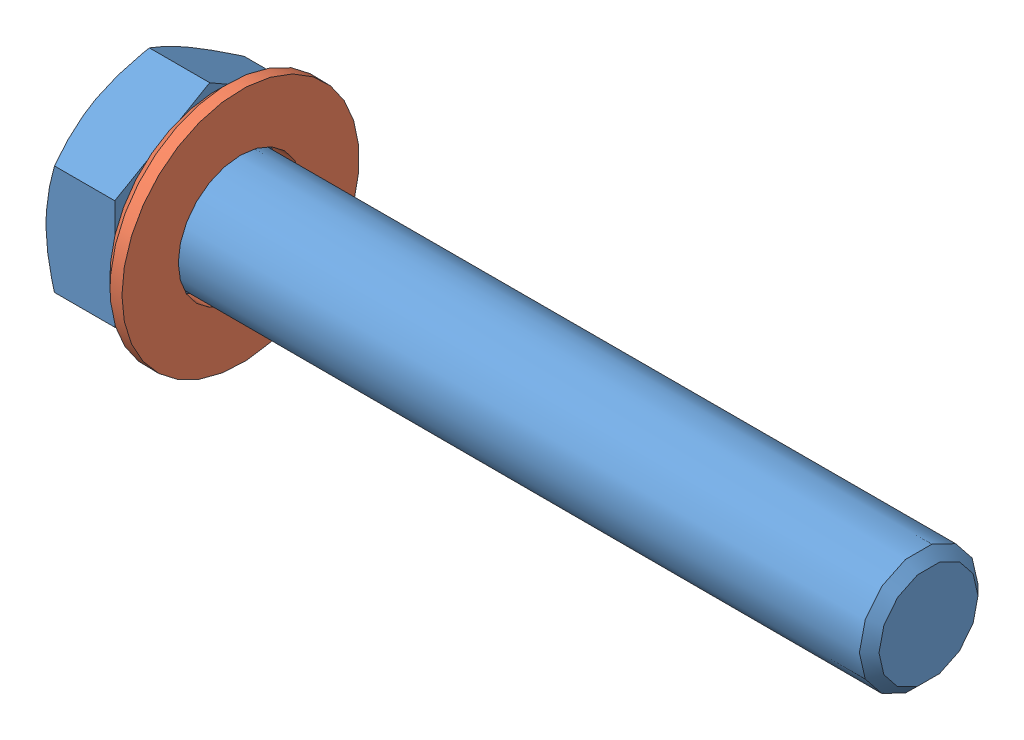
SolidWorks assembly Assemblage M10 60mm.SLDASM, configuration Défaut (file format 3400). Lengths in mm.
Overall size (66.4 20 20).
2 component instances, 2 part files, 2 mates.
Components (placement in the parent):
- Vis M10 60 mm-1: Vis M10 60 mm.SLDPRT [ISO 4014 - M10 x 60 x 26-N] at origin size (66.4 18.48 16)
- Rondelle M10-1: Rondelle M10.SLDPRT [Washer ISO 7090 - 10] at (8.4 0 0) size (2 20 20)
Mates (geometry in assembly coordinates):
- Coaxiale11: concentric: cylinder of ?; cylinder of ?
- Coïncidente1: coincident anti-aligned: plane of ?; plane of ?
